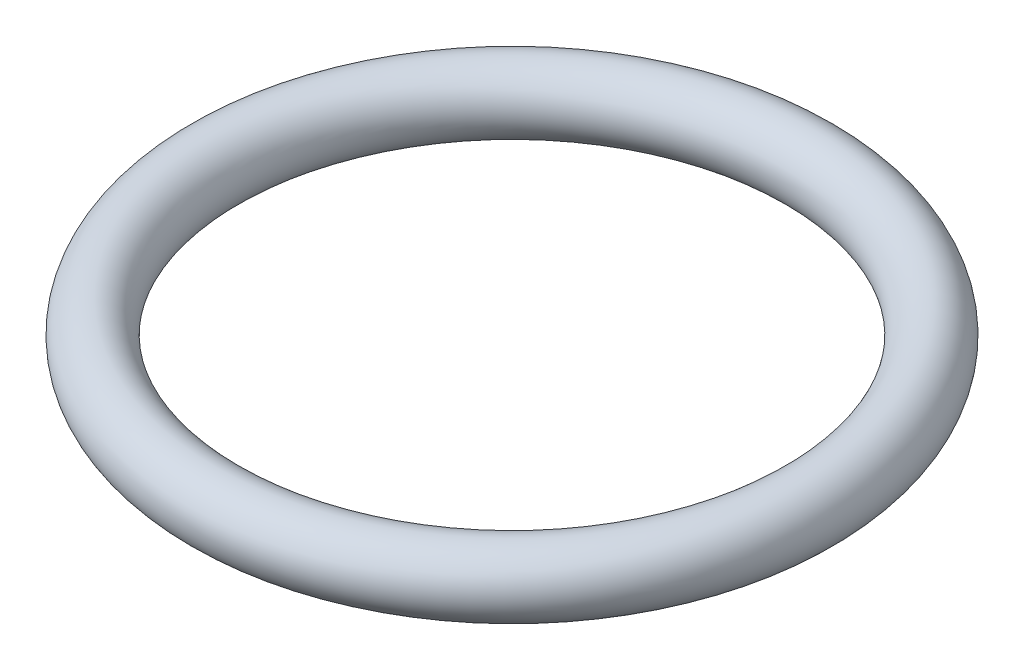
from build123d import *

# Parameters (mm, degrees)
ESQUISSE1_R = 2


with BuildPart() as part:
    # Esquisse1 → Base-R_volution (revolve)
    with BuildSketch(Plane.XY, mode=Mode.PRIVATE) as base_r_volution_sk:
        with Locations((18, 0)):
            Circle(ESQUISSE1_R)
    revolve(base_r_volution_sk.sketch.rotate(Axis((0, -43, 0), (0, 1, 0)), 90), axis=Axis((0, -43, 0), (0, 1, 0)))


solid = part.part
